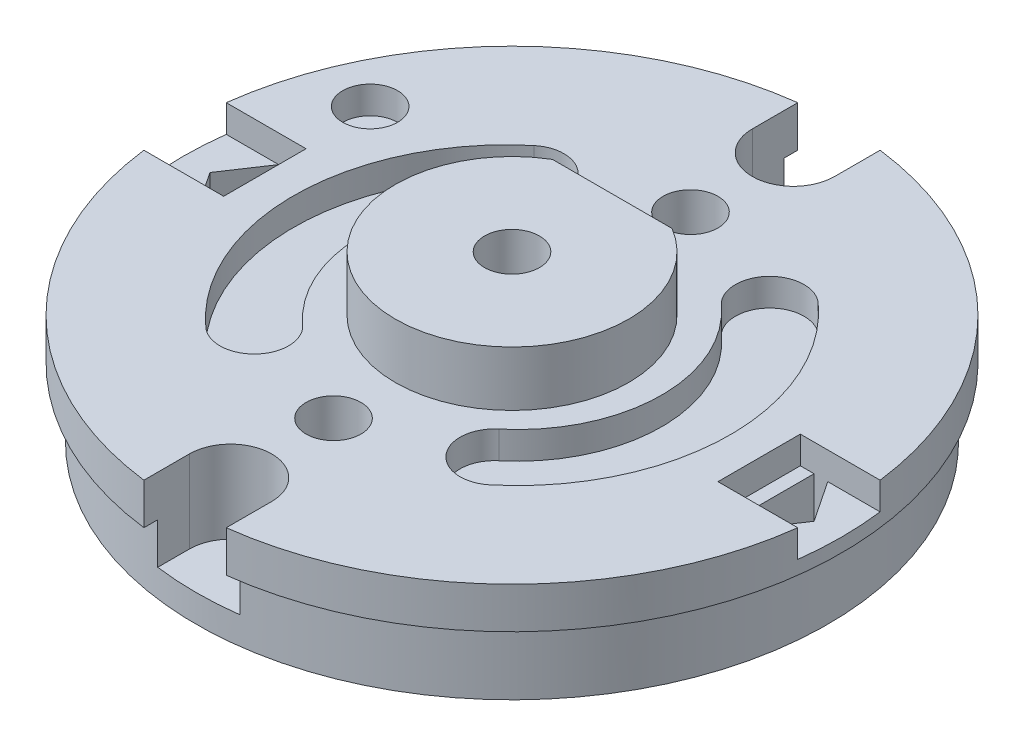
from build123d import *

# Parameters (mm, degrees)
ESQUISSE2_R                          = 1
ENL_V_MAT_EXTRU_2_DEPTH              = 19
ENL_V_DE_MAT_EXTRU_MINCE1_DEPTH      = 19
ENL_V_DE_MAT_EXTRU_MINCE1_DEPTH_BACK = 19
ESQUISSE6_W                          = 10
ESQUISSE6_H                          = 3.390207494
ENL_V_MAT_EXTRU_6_DEPTH              = 1
ENL_V_MAT_EXTRU_7_DEPTH              = 3
ENL_V_MAT_EXTRU_8_DEPTH              = 18.435595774
ESQUISSE13_W                         = 5.473530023
ESQUISSE13_H                         = 3
ENL_V_MAT_EXTRU_9_DEPTH              = 1
ESQUISSE14_R                         = 1
ENL_V_MAT_EXTRU_10_DEPTH             = 1
R_P_TITION_CIRCULAIRE2_COUNT         = 2


with BuildPart() as part:
    # Esquisse1 → R_volution1 (revolve)
    with BuildSketch(Plane.XY, mode=Mode.PRIVATE) as r_volution1_sk:
        Polygon((-8.5, 0), (-8.5, 2.5), (-1, 2.5), (-1, 6), (-4.25, 6), (-4.25, 4), (-12, 4), (-12, 2.5), (-11.5, 2.5), (-11.5, 0), align=None)
    revolve(r_volution1_sk.sketch.rotate(Axis((0, 0, 0), (0, 1, 0)), 270), axis=Axis((0, 0, 0), (0, 1, 0)))

    # Esquisse2 → Enl_v. mat.-Extru.2 (cut, through all)
    with BuildSketch(Plane(origin=(0, 0, 0), x_dir=(1, 0, 0), z_dir=(0, 1, 0))):
        with Locations(Location((0, 6.5, 0), (0, 0, 90))):
            Circle(ESQUISSE2_R)
    enl_v_mat_extru_2 = extrude(amount=ENL_V_MAT_EXTRU_2_DEPTH, mode=Mode.SUBTRACT)

    # Esquisse6 → Enl_v. de mat.-Extru.-Mince1 (cut, two sides: drawn at the far end of the back side and taken through both)
    with BuildSketch(Plane(origin=(0, 0, 0), x_dir=(0, 0, -1), z_dir=(1, 0, 0)).offset(-ENL_V_DE_MAT_EXTRU_MINCE1_DEPTH_BACK)):
        with Locations((8.65, 5.695103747)):
            Rectangle(ESQUISSE6_W, ESQUISSE6_H)
    extrude(amount=ENL_V_DE_MAT_EXTRU_MINCE1_DEPTH + ENL_V_DE_MAT_EXTRU_MINCE1_DEPTH_BACK, mode=Mode.SUBTRACT)

    # Esquisse8 → Enl_v. mat.-Extru.6 (cut)
    with BuildSketch(Plane(origin=(0, 4, 0), x_dir=(1, 0, 0), z_dir=(0, 1, 0))):
        with BuildLine():
            ThreePointArc((-4.94917232, 5.753130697), (-7.745570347, -0.050703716), (-5.187679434, -5.963531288))
            ThreePointArc((-5.187679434, -5.963531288), (-3.422259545, -5.872467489), (-3.513323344, -4.1070476))
            ThreePointArc((-3.513323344, -4.1070476), (-5.246088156, -0.10158376), (-3.351754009, 3.830046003))
            ThreePointArc((-3.351754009, 3.830046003), (-3.188920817, 5.590297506), (-4.94917232, 5.753130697))
        make_face()
    enl_v_mat_extru_6 = extrude(amount=-ENL_V_MAT_EXTRU_6_DEPTH, mode=Mode.SUBTRACT)

    # Esquisse9 → Enl_v. mat.-Extru.7 (cut)
    with BuildSketch(Plane(origin=(0, 4, 0), x_dir=(1, 0, 0), z_dir=(0, 1, 0))):
        with BuildLine():
            Line((-1.5, 10.25), (-1.5, 15))
            Line((-1.5, 15), (1.5, 15))
            Line((1.5, 15), (1.5, 10.25))
            ThreePointArc((1.5, 10.25), (0, 8.75), (-1.5, 10.25))
        make_face()
    enl_v_mat_extru_7 = extrude(amount=-ENL_V_MAT_EXTRU_7_DEPTH, mode=Mode.SUBTRACT)

    # Esquisse12 → Enl_v. mat.-Extru.8 (cut, through all)
    with BuildSketch(Plane(origin=(0, 4, 0), x_dir=(1, 0, 0), z_dir=(0, 1, 0))):
        Polygon((-11, 0), (-10, 1.5), (-9.5, 1.5), (-9.5, -1.5), (-10, -1.5), align=None)
    enl_v_mat_extru_8 = extrude(amount=-ENL_V_MAT_EXTRU_8_DEPTH, mode=Mode.SUBTRACT)

    # Esquisse13 → Enl_v. mat.-Extru.9 (cut)
    with BuildSketch(Plane(origin=(0, 4, 0), x_dir=(1, 0, 0), z_dir=(0, 1, 0))):
        with Locations((-11.736765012, 0)):
            Rectangle(ESQUISSE13_W, ESQUISSE13_H)
    enl_v_mat_extru_9 = extrude(amount=-ENL_V_MAT_EXTRU_9_DEPTH, mode=Mode.SUBTRACT)

    # Esquisse14 → Enl_v. mat.-Extru.10 (cut)
    with BuildSketch(Plane(origin=(0, 4, 0), x_dir=(1, 0, 0), z_dir=(0, 1, 0))):
        with Locations(Location((-9.16515139, 4, 0), (0, 0, 270))):
            Circle(ESQUISSE14_R)
    extrude(amount=-ENL_V_MAT_EXTRU_10_DEPTH, mode=Mode.SUBTRACT)

    # R_p_tition circulaire2: Enl_v. mat.-Extru.2, Enl_v. mat.-Extru.6, Enl_v. mat.-Extru.7, Enl_v. mat.-Extru.8, Enl_v. mat.-Extru.9 ×2 about axis
    r_p_tition_circulaire2_axis = Axis((0, 0, 0), (0, 1, 0))
    add([enl_v_mat_extru_2.rotate(r_p_tition_circulaire2_axis, i * 360 / R_P_TITION_CIRCULAIRE2_COUNT) for i in range(1, R_P_TITION_CIRCULAIRE2_COUNT)], mode=Mode.SUBTRACT)
    add([enl_v_mat_extru_6.rotate(r_p_tition_circulaire2_axis, i * 360 / R_P_TITION_CIRCULAIRE2_COUNT) for i in range(1, R_P_TITION_CIRCULAIRE2_COUNT)], mode=Mode.SUBTRACT)
    add([enl_v_mat_extru_7.rotate(r_p_tition_circulaire2_axis, i * 360 / R_P_TITION_CIRCULAIRE2_COUNT) for i in range(1, R_P_TITION_CIRCULAIRE2_COUNT)], mode=Mode.SUBTRACT)
    add([enl_v_mat_extru_8.rotate(r_p_tition_circulaire2_axis, i * 360 / R_P_TITION_CIRCULAIRE2_COUNT) for i in range(1, R_P_TITION_CIRCULAIRE2_COUNT)], mode=Mode.SUBTRACT)
    add([enl_v_mat_extru_9.rotate(r_p_tition_circulaire2_axis, i * 360 / R_P_TITION_CIRCULAIRE2_COUNT) for i in range(1, R_P_TITION_CIRCULAIRE2_COUNT)], mode=Mode.SUBTRACT)


solid = part.part
